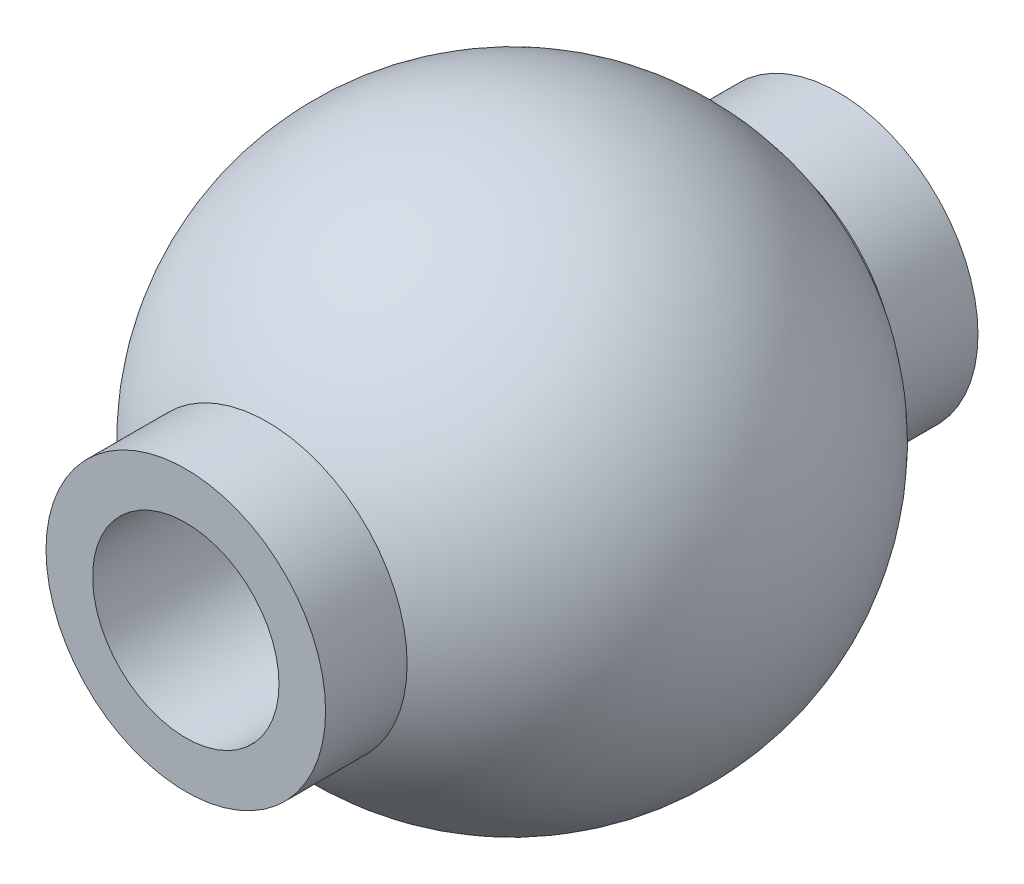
ISO-10303-21;
HEADER;
FILE_DESCRIPTION(('STEP AP214'),'2;1');
FILE_NAME('part.step','',(''),(''),'','','');
FILE_SCHEMA(('AUTOMOTIVE_DESIGN { 1 0 10303 214 1 1 1 1 }'));
ENDSEC;
DATA;
#1=APPLICATION_CONTEXT('core data for automotive mechanical design processes');
#2=APPLICATION_PROTOCOL_DEFINITION('international standard','automotive_design',2000,#1);
#3=PRODUCT_CONTEXT('',#1,'mechanical');
#4=PRODUCT('Part','Part','',(#3));
#5=PRODUCT_RELATED_PRODUCT_CATEGORY('part','',(#4));
#6=PRODUCT_DEFINITION_FORMATION('','',#4);
#7=PRODUCT_DEFINITION_CONTEXT('part definition',#1,'design');
#8=PRODUCT_DEFINITION('design','',#6,#7);
#9=PRODUCT_DEFINITION_SHAPE('','',#8);
#10=(LENGTH_UNIT() NAMED_UNIT(*) SI_UNIT(.MILLI.,.METRE.));
#11=(NAMED_UNIT(*) PLANE_ANGLE_UNIT() SI_UNIT($,.RADIAN.));
#12=(NAMED_UNIT(*) SI_UNIT($,.STERADIAN.) SOLID_ANGLE_UNIT());
#13=UNCERTAINTY_MEASURE_WITH_UNIT(LENGTH_MEASURE(1.E-05),#10,'distance_accuracy_value','');
#14=(GEOMETRIC_REPRESENTATION_CONTEXT(3) GLOBAL_UNCERTAINTY_ASSIGNED_CONTEXT((#13)) GLOBAL_UNIT_ASSIGNED_CONTEXT((#10,
#11,#12)) REPRESENTATION_CONTEXT('',''));
#15=CARTESIAN_POINT('',(0.,0.,0.));
#16=DIRECTION('',(0.,0.,1.));
#17=DIRECTION('',(1.,0.,0.));
#18=AXIS2_PLACEMENT_3D('',#15,#16,#17);
#19=CARTESIAN_POINT('',(0.,0.,0.));
#20=DIRECTION('',(0.,0.,-1.));
#21=DIRECTION('',(1.,0.,0.));
#22=AXIS2_PLACEMENT_3D('',#19,#20,#21);
#23=SPHERICAL_SURFACE('',#22,6.);
#24=CARTESIAN_POINT('',(0.,0.,5.25));
#25=DIRECTION('',(0.,0.,1.));
#26=DIRECTION('',(1.,0.,0.));
#27=AXIS2_PLACEMENT_3D('',#24,#25,#26);
#28=CIRCLE('',#27,2.90473750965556);
#29=CARTESIAN_POINT('',(2.90473750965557,0.,5.25));
#30=VERTEX_POINT('',#29);
#31=EDGE_CURVE('E352',#30,#30,#28,.T.);
#32=CARTESIAN_POINT('',(0.,0.,-5.25));
#33=DIRECTION('',(0.,0.,-1.));
#34=DIRECTION('',(-1.,0.,0.));
#35=AXIS2_PLACEMENT_3D('',#32,#33,#34);
#36=CIRCLE('',#35,2.90473750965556);
#37=CARTESIAN_POINT('',(2.90473750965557,0.,-5.25));
#38=VERTEX_POINT('',#37);
#39=EDGE_CURVE('E10',#38,#38,#36,.T.);
#40=CARTESIAN_POINT('',(2.90473750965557,0.,5.25));
#41=CARTESIAN_POINT('',(3.02127336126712,0.,5.18553070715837));
#42=CARTESIAN_POINT('',(3.13565510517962,0.,5.11716977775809));
#43=CARTESIAN_POINT('',(3.35962014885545,0.,4.97299371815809));
#44=CARTESIAN_POINT('',(3.46920344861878,0.,4.89717858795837));
#45=CARTESIAN_POINT('',(3.68308137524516,0.,4.73842319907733));
#46=CARTESIAN_POINT('',(3.78737600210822,0.,4.65548294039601));
#47=CARTESIAN_POINT('',(3.99021549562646,0.,4.48284680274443));
#48=CARTESIAN_POINT('',(4.08876036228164,0.,4.39315092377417));
#49=CARTESIAN_POINT('',(4.27966320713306,0.,4.20740062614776));
#50=CARTESIAN_POINT('',(4.37202118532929,0.,4.1113462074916));
#51=CARTESIAN_POINT('',(4.55014095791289,0.,3.91330473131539));
#52=CARTESIAN_POINT('',(4.63590275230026,0.,3.81131767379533));
#53=CARTESIAN_POINT('',(4.80044999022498,0.,3.6018629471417));
#54=CARTESIAN_POINT('',(4.87923543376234,0.,3.49439527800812));
#55=CARTESIAN_POINT('',(5.02948075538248,0.,3.27445569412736));
#56=CARTESIAN_POINT('',(5.10094063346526,0.,3.16198377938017));
#57=CARTESIAN_POINT('',(5.23621807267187,0.,2.93253423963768));
#58=CARTESIAN_POINT('',(5.3000356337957,0.,2.81555661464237));
#59=CARTESIAN_POINT('',(5.41974556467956,0.,2.57761416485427));
#60=CARTESIAN_POINT('',(5.47563793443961,0.,2.45664934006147));
#61=CARTESIAN_POINT('',(5.57924973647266,0.,2.21126867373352));
#62=CARTESIAN_POINT('',(5.62696916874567,0.,2.08685283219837));
#63=CARTESIAN_POINT('',(5.71402357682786,0.,1.83512161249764));
#64=CARTESIAN_POINT('',(5.75335855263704,0.,1.70780623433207));
#65=CARTESIAN_POINT('',(5.82346969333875,0.,1.45084027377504));
#66=CARTESIAN_POINT('',(5.85424585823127,0.,1.32118969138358));
#67=CARTESIAN_POINT('',(5.90710296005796,0.,1.06012800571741));
#68=CARTESIAN_POINT('',(5.92918389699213,0.,0.928716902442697));
#69=CARTESIAN_POINT('',(5.96455266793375,0.,0.664716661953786));
#70=CARTESIAN_POINT('',(5.97784050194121,0.,0.532127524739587));
#71=CARTESIAN_POINT('',(5.99556416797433,0.,0.266358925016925));
#72=CARTESIAN_POINT('',(6.,0.,0.133179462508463));
#73=CARTESIAN_POINT('',(6.,0.,-0.133179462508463));
#74=CARTESIAN_POINT('',(5.99556416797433,0.,-0.266358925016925));
#75=CARTESIAN_POINT('',(5.97784050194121,0.,-0.532127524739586));
#76=CARTESIAN_POINT('',(5.96455266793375,0.,-0.664716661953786));
#77=CARTESIAN_POINT('',(5.92918389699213,0.,-0.928716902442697));
#78=CARTESIAN_POINT('',(5.90710296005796,0.,-1.06012800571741));
#79=CARTESIAN_POINT('',(5.85424585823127,0.,-1.32118969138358));
#80=CARTESIAN_POINT('',(5.82346969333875,0.,-1.45084027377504));
#81=CARTESIAN_POINT('',(5.75335855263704,0.,-1.70780623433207));
#82=CARTESIAN_POINT('',(5.71402357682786,0.,-1.83512161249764));
#83=CARTESIAN_POINT('',(5.62696916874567,0.,-2.08685283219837));
#84=CARTESIAN_POINT('',(5.57924973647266,0.,-2.21126867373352));
#85=CARTESIAN_POINT('',(5.47563793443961,0.,-2.45664934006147));
#86=CARTESIAN_POINT('',(5.41974556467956,0.,-2.57761416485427));
#87=CARTESIAN_POINT('',(5.3000356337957,0.,-2.81555661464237));
#88=CARTESIAN_POINT('',(5.23621807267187,0.,-2.93253423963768));
#89=CARTESIAN_POINT('',(5.10094063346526,0.,-3.16198377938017));
#90=CARTESIAN_POINT('',(5.02948075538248,0.,-3.27445569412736));
#91=CARTESIAN_POINT('',(4.87923543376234,0.,-3.49439527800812));
#92=CARTESIAN_POINT('',(4.80044999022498,0.,-3.6018629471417));
#93=CARTESIAN_POINT('',(4.63590275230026,0.,-3.81131767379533));
#94=CARTESIAN_POINT('',(4.55014095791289,0.,-3.91330473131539));
#95=CARTESIAN_POINT('',(4.37202118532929,0.,-4.1113462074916));
#96=CARTESIAN_POINT('',(4.27966320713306,0.,-4.20740062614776));
#97=CARTESIAN_POINT('',(4.08876036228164,0.,-4.39315092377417));
#98=CARTESIAN_POINT('',(3.99021549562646,0.,-4.48284680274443));
#99=CARTESIAN_POINT('',(3.78737600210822,0.,-4.65548294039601));
#100=CARTESIAN_POINT('',(3.68308137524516,0.,-4.73842319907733));
#101=CARTESIAN_POINT('',(3.46920344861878,0.,-4.89717858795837));
#102=CARTESIAN_POINT('',(3.35962014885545,0.,-4.97299371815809));
#103=CARTESIAN_POINT('',(3.13565510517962,0.,-5.11716977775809));
#104=CARTESIAN_POINT('',(3.02127336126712,0.,-5.18553070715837));
#105=CARTESIAN_POINT('',(2.90473750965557,0.,-5.25));
#106=B_SPLINE_CURVE_WITH_KNOTS('',3,(#40,#41,#42,#43,#44,#45,#46,#47,#48,#49,#50,#51,#52,#53,
#54,#55,#56,#57,#58,#59,#60,#61,#62,#63,#64,#65,#66,#67,#68,#69,#70,#71,#72,#73,#74,#75,#76,#77,
#78,#79,#80,#81,#82,#83,#84,#85,#86,#87,#88,#89,#90,#91,#92,#93,#94,#95,#96,#97,#98,#99,#100,
#101,#102,#103,#104,#105),.UNSPECIFIED.,.F.,.F.,(4,2,2,2,2,2,2,2,2,2,2,2,2,2,2,2,2,2,2,2,2,2,2,
2,2,2,2,2,2,2,2,2,4),(0.,0.399464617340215,0.798929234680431,1.19839385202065,1.59785846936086,
1.99732308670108,2.39678770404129,2.79625232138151,3.19571693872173,3.59518155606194,
3.99464617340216,4.39411079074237,4.79357540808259,5.1930400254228,5.59250464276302,
5.99196926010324,6.39143387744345,6.79089849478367,7.19036311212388,7.5898277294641,
7.98929234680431,8.38875696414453,8.78822158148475,9.18768619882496,9.58715081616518,
9.98661543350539,10.3860800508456,10.7855446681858,11.185009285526,11.5844739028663,
11.9839385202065,12.3834031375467,12.7828677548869),.UNSPECIFIED.);
#107=EDGE_CURVE('BSEAM346',#30,#38,#106,.T.);
#108=ORIENTED_EDGE('',*,*,#31,.F.);
#109=ORIENTED_EDGE('',*,*,#39,.F.);
#110=ORIENTED_EDGE('',*,*,#107,.T.);
#111=ORIENTED_EDGE('',*,*,#107,.F.);
#112=EDGE_LOOP('',(#108,#110,#109,#111));
#113=FACE_BOUND('',#112,.T.);
#114=ADVANCED_FACE('F346',(#113),#23,.T.);
#115=CARTESIAN_POINT('',(0.,0.,5.25));
#116=DIRECTION('',(0.,0.,1.));
#117=DIRECTION('',(1.,0.,0.));
#118=AXIS2_PLACEMENT_3D('',#115,#116,#117);
#119=PLANE('',#118);
#120=CARTESIAN_POINT('',(0.,0.,5.25));
#121=DIRECTION('',(0.,0.,1.));
#122=DIRECTION('',(1.,0.,0.));
#123=AXIS2_PLACEMENT_3D('',#120,#121,#122);
#124=CIRCLE('',#123,3.);
#125=CARTESIAN_POINT('',(3.,0.,5.25));
#126=VERTEX_POINT('',#125);
#127=EDGE_CURVE('E356',#126,#126,#124,.T.);
#128=ORIENTED_EDGE('',*,*,#127,.F.);
#129=EDGE_LOOP('',(#128));
#130=FACE_BOUND('',#129,.T.);
#131=ORIENTED_EDGE('',*,*,#31,.T.);
#132=EDGE_LOOP('',(#131));
#133=FACE_BOUND('',#132,.T.);
#134=ADVANCED_FACE('F389',(#130,#133),#119,.F.);
#135=CARTESIAN_POINT('',(0.,0.,5.25));
#136=DIRECTION('',(0.,0.,1.));
#137=DIRECTION('',(1.,0.,0.));
#138=AXIS2_PLACEMENT_3D('',#135,#136,#137);
#139=CYLINDRICAL_SURFACE('',#138,3.);
#140=ORIENTED_EDGE('',*,*,#127,.T.);
#141=EDGE_LOOP('',(#140));
#142=FACE_BOUND('',#141,.T.);
#143=CARTESIAN_POINT('',(0.,0.,7.));
#144=DIRECTION('',(0.,0.,1.));
#145=DIRECTION('',(1.,0.,0.));
#146=AXIS2_PLACEMENT_3D('',#143,#144,#145);
#147=CIRCLE('',#146,3.);
#148=CARTESIAN_POINT('',(3.,0.,7.));
#149=VERTEX_POINT('',#148);
#150=EDGE_CURVE('E360',#149,#149,#147,.T.);
#151=ORIENTED_EDGE('',*,*,#150,.F.);
#152=EDGE_LOOP('',(#151));
#153=FACE_BOUND('',#152,.T.);
#154=ADVANCED_FACE('F384',(#142,#153),#139,.T.);
#155=CARTESIAN_POINT('',(0.,0.,7.));
#156=DIRECTION('',(0.,0.,1.));
#157=DIRECTION('',(1.,0.,0.));
#158=AXIS2_PLACEMENT_3D('',#155,#156,#157);
#159=PLANE('',#158);
#160=CARTESIAN_POINT('',(0.,0.,7.));
#161=DIRECTION('',(0.,0.,1.));
#162=DIRECTION('',(1.,0.,0.));
#163=AXIS2_PLACEMENT_3D('',#160,#161,#162);
#164=CIRCLE('',#163,2.);
#165=CARTESIAN_POINT('',(2.,0.,7.));
#166=VERTEX_POINT('',#165);
#167=EDGE_CURVE('E374',#166,#166,#164,.T.);
#168=ORIENTED_EDGE('',*,*,#167,.F.);
#169=EDGE_LOOP('',(#168));
#170=FACE_BOUND('',#169,.T.);
#171=ORIENTED_EDGE('',*,*,#150,.T.);
#172=EDGE_LOOP('',(#171));
#173=FACE_BOUND('',#172,.T.);
#174=ADVANCED_FACE('F380',(#170,#173),#159,.T.);
#175=CARTESIAN_POINT('',(0.,0.,-5.25));
#176=DIRECTION('',(0.,0.,-1.));
#177=DIRECTION('',(1.,0.,0.));
#178=AXIS2_PLACEMENT_3D('',#175,#176,#177);
#179=PLANE('',#178);
#180=CARTESIAN_POINT('',(0.,0.,-5.25));
#181=DIRECTION('',(0.,0.,1.));
#182=DIRECTION('',(1.,0.,0.));
#183=AXIS2_PLACEMENT_3D('',#180,#181,#182);
#184=CIRCLE('',#183,3.);
#185=CARTESIAN_POINT('',(3.,0.,-5.25));
#186=VERTEX_POINT('',#185);
#187=EDGE_CURVE('E365',#186,#186,#184,.T.);
#188=ORIENTED_EDGE('',*,*,#187,.T.);
#189=EDGE_LOOP('',(#188));
#190=FACE_BOUND('',#189,.T.);
#191=ORIENTED_EDGE('',*,*,#39,.T.);
#192=EDGE_LOOP('',(#191));
#193=FACE_BOUND('',#192,.T.);
#194=ADVANCED_FACE('F383',(#190,#193),#179,.F.);
#195=CARTESIAN_POINT('',(0.,0.,-5.25));
#196=DIRECTION('',(0.,0.,-1.));
#197=DIRECTION('',(-1.,0.,0.));
#198=AXIS2_PLACEMENT_3D('',#195,#196,#197);
#199=CYLINDRICAL_SURFACE('',#198,3.);
#200=ORIENTED_EDGE('',*,*,#187,.F.);
#201=EDGE_LOOP('',(#200));
#202=FACE_BOUND('',#201,.T.);
#203=CARTESIAN_POINT('',(0.,0.,-7.));
#204=DIRECTION('',(0.,0.,1.));
#205=DIRECTION('',(1.,0.,0.));
#206=AXIS2_PLACEMENT_3D('',#203,#204,#205);
#207=CIRCLE('',#206,3.);
#208=CARTESIAN_POINT('',(3.,0.,-7.));
#209=VERTEX_POINT('',#208);
#210=EDGE_CURVE('E368',#209,#209,#207,.T.);
#211=ORIENTED_EDGE('',*,*,#210,.T.);
#212=EDGE_LOOP('',(#211));
#213=FACE_BOUND('',#212,.T.);
#214=ADVANCED_FACE('F417',(#202,#213),#199,.T.);
#215=CARTESIAN_POINT('',(0.,0.,-7.));
#216=DIRECTION('',(0.,0.,-1.));
#217=DIRECTION('',(1.,0.,0.));
#218=AXIS2_PLACEMENT_3D('',#215,#216,#217);
#219=PLANE('',#218);
#220=CARTESIAN_POINT('',(0.,0.,-7.));
#221=DIRECTION('',(0.,0.,1.));
#222=DIRECTION('',(1.,0.,0.));
#223=AXIS2_PLACEMENT_3D('',#220,#221,#222);
#224=CIRCLE('',#223,2.);
#225=CARTESIAN_POINT('',(2.,0.,-7.));
#226=VERTEX_POINT('',#225);
#227=EDGE_CURVE('E371',#226,#226,#224,.T.);
#228=ORIENTED_EDGE('',*,*,#227,.T.);
#229=EDGE_LOOP('',(#228));
#230=FACE_BOUND('',#229,.T.);
#231=ORIENTED_EDGE('',*,*,#210,.F.);
#232=EDGE_LOOP('',(#231));
#233=FACE_BOUND('',#232,.T.);
#234=ADVANCED_FACE('F425',(#230,#233),#219,.T.);
#235=CARTESIAN_POINT('',(0.,0.,-7.));
#236=DIRECTION('',(0.,0.,1.));
#237=DIRECTION('',(1.,0.,0.));
#238=AXIS2_PLACEMENT_3D('',#235,#236,#237);
#239=CYLINDRICAL_SURFACE('',#238,2.);
#240=ORIENTED_EDGE('',*,*,#227,.F.);
#241=EDGE_LOOP('',(#240));
#242=FACE_BOUND('',#241,.T.);
#243=ORIENTED_EDGE('',*,*,#167,.T.);
#244=EDGE_LOOP('',(#243));
#245=FACE_BOUND('',#244,.T.);
#246=ADVANCED_FACE('F378',(#242,#245),#239,.F.);
#247=CLOSED_SHELL('',(#114,#134,#154,#174,#194,#214,#234,#246));
#248=MANIFOLD_SOLID_BREP('B2',#247);
#249=ADVANCED_BREP_SHAPE_REPRESENTATION('',(#18,#248),#14);
#250=SHAPE_DEFINITION_REPRESENTATION(#9,#249);
ENDSEC;
END-ISO-10303-21;
